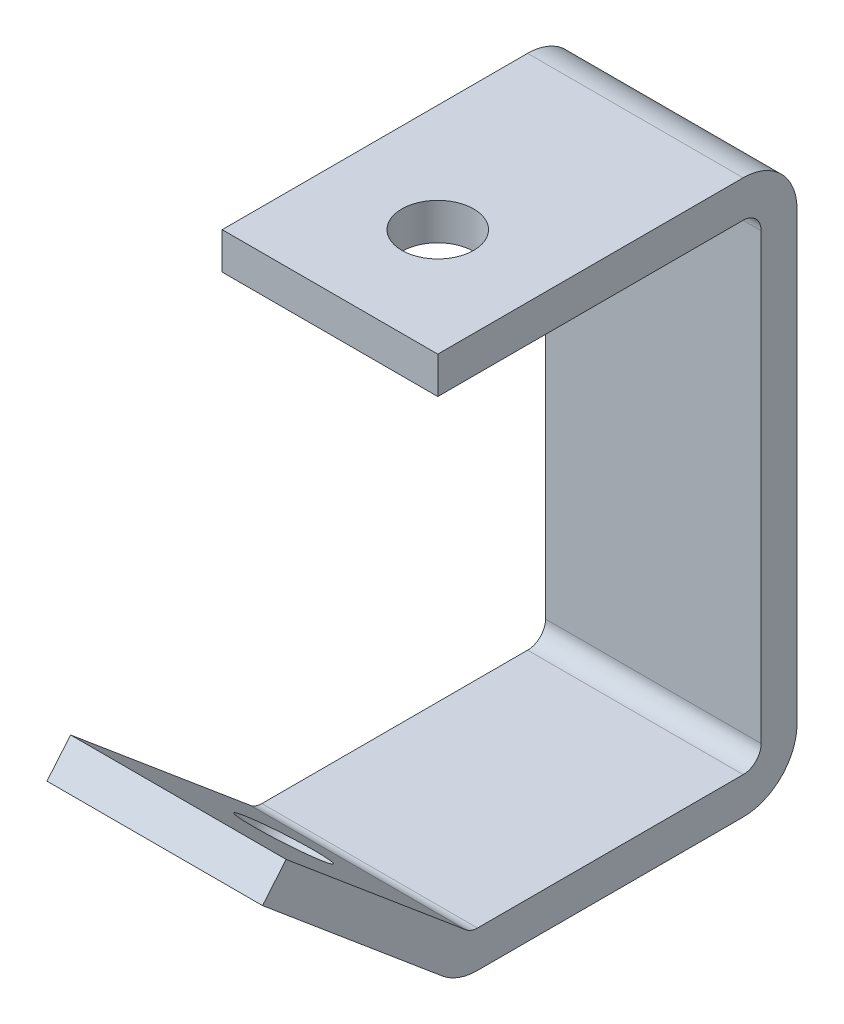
ISO-10303-21;
HEADER;
FILE_DESCRIPTION(('STEP AP214'),'2;1');
FILE_NAME('part.step','',(''),(''),'','','');
FILE_SCHEMA(('AUTOMOTIVE_DESIGN { 1 0 10303 214 1 1 1 1 }'));
ENDSEC;
DATA;
#1=APPLICATION_CONTEXT('core data for automotive mechanical design processes');
#2=APPLICATION_PROTOCOL_DEFINITION('international standard','automotive_design',2000,#1);
#3=PRODUCT_CONTEXT('',#1,'mechanical');
#4=PRODUCT('Part','Part','',(#3));
#5=PRODUCT_RELATED_PRODUCT_CATEGORY('part','',(#4));
#6=PRODUCT_DEFINITION_FORMATION('','',#4);
#7=PRODUCT_DEFINITION_CONTEXT('part definition',#1,'design');
#8=PRODUCT_DEFINITION('design','',#6,#7);
#9=PRODUCT_DEFINITION_SHAPE('','',#8);
#10=(LENGTH_UNIT() NAMED_UNIT(*) SI_UNIT(.MILLI.,.METRE.));
#11=(NAMED_UNIT(*) PLANE_ANGLE_UNIT() SI_UNIT($,.RADIAN.));
#12=(NAMED_UNIT(*) SI_UNIT($,.STERADIAN.) SOLID_ANGLE_UNIT());
#13=UNCERTAINTY_MEASURE_WITH_UNIT(LENGTH_MEASURE(1.E-05),#10,'distance_accuracy_value','');
#14=(GEOMETRIC_REPRESENTATION_CONTEXT(3) GLOBAL_UNCERTAINTY_ASSIGNED_CONTEXT((#13)) GLOBAL_UNIT_ASSIGNED_CONTEXT((#10,
#11,#12)) REPRESENTATION_CONTEXT('',''));
#15=CARTESIAN_POINT('',(0.,0.,0.));
#16=DIRECTION('',(0.,0.,1.));
#17=DIRECTION('',(1.,0.,0.));
#18=AXIS2_PLACEMENT_3D('',#15,#16,#17);
#19=CARTESIAN_POINT('',(19.05,91.35,0.));
#20=DIRECTION('',(0.,0.,-1.));
#21=DIRECTION('',(0.,1.,0.));
#22=AXIS2_PLACEMENT_3D('',#19,#20,#21);
#23=PLANE('',#22);
#24=DIRECTION('',(0.,-1.,0.));
#25=VECTOR('',#24,1.);
#26=CARTESIAN_POINT('',(-19.05,91.35,0.));
#27=LINE('',#26,#25);
#28=CARTESIAN_POINT('',(-19.05,81.675,0.));
#29=VERTEX_POINT('',#28);
#30=CARTESIAN_POINT('',(-19.05,3.17499999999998,0.));
#31=VERTEX_POINT('',#30);
#32=EDGE_CURVE('E188',#29,#31,#27,.T.);
#33=ORIENTED_EDGE('',*,*,#32,.T.);
#34=DIRECTION('',(1.,0.,0.));
#35=VECTOR('',#34,1.);
#36=CARTESIAN_POINT('',(19.05,3.17499999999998,0.));
#37=LINE('',#36,#35);
#38=CARTESIAN_POINT('',(19.05,3.17499999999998,0.));
#39=VERTEX_POINT('',#38);
#40=EDGE_CURVE('E243',#31,#39,#37,.T.);
#41=ORIENTED_EDGE('',*,*,#40,.T.);
#42=DIRECTION('',(0.,-1.,0.));
#43=VECTOR('',#42,1.);
#44=CARTESIAN_POINT('',(19.05,91.35,0.));
#45=LINE('',#44,#43);
#46=CARTESIAN_POINT('',(19.05,81.675,0.));
#47=VERTEX_POINT('',#46);
#48=EDGE_CURVE('E185',#47,#39,#45,.T.);
#49=ORIENTED_EDGE('',*,*,#48,.F.);
#50=DIRECTION('',(1.,0.,0.));
#51=VECTOR('',#50,1.);
#52=CARTESIAN_POINT('',(-19.05,81.675,0.));
#53=LINE('',#52,#51);
#54=EDGE_CURVE('E227',#47,#29,#53,.F.);
#55=ORIENTED_EDGE('',*,*,#54,.T.);
#56=EDGE_LOOP('',(#33,#41,#49,#55));
#57=FACE_BOUND('',#56,.T.);
#58=ADVANCED_FACE('F34',(#57),#23,.F.);
#59=CARTESIAN_POINT('',(-19.05,0.,-6.34999999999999));
#60=DIRECTION('',(0.,1.,0.));
#61=DIRECTION('',(0.,0.,1.));
#62=AXIS2_PLACEMENT_3D('',#59,#60,#61);
#63=PLANE('',#62);
#64=DIRECTION('',(0.,0.,1.));
#65=VECTOR('',#64,1.);
#66=CARTESIAN_POINT('',(19.05,0.,-6.34999999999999));
#67=LINE('',#66,#65);
#68=CARTESIAN_POINT('',(19.05,0.,3.175));
#69=VERTEX_POINT('',#68);
#70=CARTESIAN_POINT('',(19.05,0.,50.1285879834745));
#71=VERTEX_POINT('',#70);
#72=EDGE_CURVE('E212',#69,#71,#67,.T.);
#73=ORIENTED_EDGE('',*,*,#72,.F.);
#74=DIRECTION('',(1.,0.,0.));
#75=VECTOR('',#74,1.);
#76=CARTESIAN_POINT('',(-19.05,0.,3.175));
#77=LINE('',#76,#75);
#78=CARTESIAN_POINT('',(-19.05,0.,3.175));
#79=VERTEX_POINT('',#78);
#80=EDGE_CURVE('E246',#69,#79,#77,.F.);
#81=ORIENTED_EDGE('',*,*,#80,.T.);
#82=DIRECTION('',(0.,0.,1.));
#83=VECTOR('',#82,1.);
#84=CARTESIAN_POINT('',(-19.05,0.,-6.34999999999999));
#85=LINE('',#84,#83);
#86=CARTESIAN_POINT('',(-19.05,0.,50.1285879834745));
#87=VERTEX_POINT('',#86);
#88=EDGE_CURVE('E198',#79,#87,#85,.T.);
#89=ORIENTED_EDGE('',*,*,#88,.T.);
#90=DIRECTION('',(1.,0.,0.));
#91=VECTOR('',#90,1.);
#92=CARTESIAN_POINT('',(19.05,0.,50.1285879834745));
#93=LINE('',#92,#91);
#94=EDGE_CURVE('E233',#87,#71,#93,.T.);
#95=ORIENTED_EDGE('',*,*,#94,.T.);
#96=EDGE_LOOP('',(#73,#81,#89,#95));
#97=FACE_BOUND('',#96,.T.);
#98=ADVANCED_FACE('F300',(#97),#63,.T.);
#99=CARTESIAN_POINT('',(-19.05,-6.5,53.65));
#100=DIRECTION('',(0.,-1.,0.));
#101=DIRECTION('',(0.,0.,-1.));
#102=AXIS2_PLACEMENT_3D('',#99,#100,#101);
#103=PLANE('',#102);
#104=DIRECTION('',(0.,0.,-1.));
#105=VECTOR('',#104,1.);
#106=CARTESIAN_POINT('',(19.05,-6.5,53.65));
#107=LINE('',#106,#105);
#108=CARTESIAN_POINT('',(19.05,-6.5,50.1831835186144));
#109=VERTEX_POINT('',#108);
#110=CARTESIAN_POINT('',(19.05,-6.5,3.17500000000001));
#111=VERTEX_POINT('',#110);
#112=EDGE_CURVE('E191',#109,#111,#107,.T.);
#113=ORIENTED_EDGE('',*,*,#112,.F.);
#114=DIRECTION('',(1.,0.,0.));
#115=VECTOR('',#114,1.);
#116=CARTESIAN_POINT('',(-19.05,-6.5,50.1831835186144));
#117=LINE('',#116,#115);
#118=CARTESIAN_POINT('',(-19.05,-6.5,50.1831835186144));
#119=VERTEX_POINT('',#118);
#120=EDGE_CURVE('E42',#109,#119,#117,.F.);
#121=ORIENTED_EDGE('',*,*,#120,.T.);
#122=DIRECTION('',(0.,0.,-1.));
#123=VECTOR('',#122,1.);
#124=CARTESIAN_POINT('',(-19.05,-6.5,53.65));
#125=LINE('',#124,#123);
#126=CARTESIAN_POINT('',(-19.05,-6.5,3.17500000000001));
#127=VERTEX_POINT('',#126);
#128=EDGE_CURVE('E192',#119,#127,#125,.T.);
#129=ORIENTED_EDGE('',*,*,#128,.T.);
#130=DIRECTION('',(1.,0.,0.));
#131=VECTOR('',#130,1.);
#132=CARTESIAN_POINT('',(-19.05,-6.5,3.17500000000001));
#133=LINE('',#132,#131);
#134=EDGE_CURVE('E252',#127,#111,#133,.T.);
#135=ORIENTED_EDGE('',*,*,#134,.T.);
#136=EDGE_LOOP('',(#113,#121,#129,#135));
#137=FACE_BOUND('',#136,.T.);
#138=ADVANCED_FACE('F306',(#137),#103,.T.);
#139=CARTESIAN_POINT('',(-19.05,22.4254424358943,88.121999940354));
#140=DIRECTION('',(0.,-0.766044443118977,0.64278760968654));
#141=DIRECTION('',(0.,-0.64278760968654,-0.766044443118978));
#142=AXIS2_PLACEMENT_3D('',#139,#140,#141);
#143=PLANE('',#142);
#144=CARTESIAN_POINT('',(-1.23956400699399E-13,6.81179721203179,69.5143821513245));
#145=DIRECTION('',(0.,-0.766044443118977,0.64278760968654));
#146=DIRECTION('',(0.,-0.64278760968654,-0.766044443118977));
#147=AXIS2_PLACEMENT_3D('',#144,#145,#146);
#148=CIRCLE('',#147,7.);
#149=CARTESIAN_POINT('',(-1.23956400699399E-13,2.31228394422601,64.1520710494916));
#150=VERTEX_POINT('',#149);
#151=EDGE_CURVE('E390',#150,#150,#148,.T.);
#152=ORIENTED_EDGE('',*,*,#151,.F.);
#153=EDGE_LOOP('',(#152));
#154=FACE_BOUND('',#153,.T.);
#155=DIRECTION('',(0.,-0.64278760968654,-0.766044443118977));
#156=VECTOR('',#155,1.);
#157=CARTESIAN_POINT('',(-19.05,22.4254424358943,88.121999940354));
#158=LINE('',#157,#156);
#159=CARTESIAN_POINT('',(-19.05,22.4254424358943,88.121999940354));
#160=VERTEX_POINT('',#159);
#161=CARTESIAN_POINT('',(-19.05,-4.27157332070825,56.3057355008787));
#162=VERTEX_POINT('',#161);
#163=EDGE_CURVE('E205',#160,#162,#158,.T.);
#164=ORIENTED_EDGE('',*,*,#163,.T.);
#165=DIRECTION('',(1.,0.,0.));
#166=VECTOR('',#165,1.);
#167=CARTESIAN_POINT('',(-19.05,-4.27157332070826,56.3057355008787));
#168=LINE('',#167,#166);
#169=CARTESIAN_POINT('',(19.05,-4.27157332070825,56.3057355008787));
#170=VERTEX_POINT('',#169);
#171=EDGE_CURVE('E269',#162,#170,#168,.T.);
#172=ORIENTED_EDGE('',*,*,#171,.T.);
#173=DIRECTION('',(0.,-0.64278760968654,-0.766044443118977));
#174=VECTOR('',#173,1.);
#175=CARTESIAN_POINT('',(19.05,22.4254424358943,88.121999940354));
#176=LINE('',#175,#174);
#177=CARTESIAN_POINT('',(19.05,22.4254424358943,88.121999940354));
#178=VERTEX_POINT('',#177);
#179=EDGE_CURVE('E195',#178,#170,#176,.T.);
#180=ORIENTED_EDGE('',*,*,#179,.F.);
#181=DIRECTION('',(1.,0.,0.));
#182=VECTOR('',#181,1.);
#183=CARTESIAN_POINT('',(-19.05,22.4254424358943,88.121999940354));
#184=LINE('',#183,#182);
#185=EDGE_CURVE('E220',#160,#178,#184,.T.);
#186=ORIENTED_EDGE('',*,*,#185,.F.);
#187=EDGE_LOOP('',(#164,#172,#180,#186));
#188=FACE_BOUND('',#187,.T.);
#189=ADVANCED_FACE('F275',(#154,#188),#143,.T.);
#190=CARTESIAN_POINT('',(-19.05,27.4047313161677,83.9438804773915));
#191=DIRECTION('',(0.,0.64278760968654,0.766044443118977));
#192=DIRECTION('',(0.,-0.766044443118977,0.64278760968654));
#193=AXIS2_PLACEMENT_3D('',#190,#191,#192);
#194=PLANE('',#193);
#195=DIRECTION('',(0.,-0.766044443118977,0.64278760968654));
#196=VECTOR('',#195,1.);
#197=CARTESIAN_POINT('',(19.05,27.4047313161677,83.9438804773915));
#198=LINE('',#197,#196);
#199=CARTESIAN_POINT('',(19.05,27.4047313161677,83.9438804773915));
#200=VERTEX_POINT('',#199);
#201=EDGE_CURVE('E216',#200,#178,#198,.T.);
#202=ORIENTED_EDGE('',*,*,#201,.F.);
#203=DIRECTION('',(1.,0.,0.));
#204=VECTOR('',#203,1.);
#205=CARTESIAN_POINT('',(-19.05,27.4047313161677,83.9438804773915));
#206=LINE('',#205,#204);
#207=CARTESIAN_POINT('',(-19.05,27.4047313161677,83.9438804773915));
#208=VERTEX_POINT('',#207);
#209=EDGE_CURVE('E208',#208,#200,#206,.T.);
#210=ORIENTED_EDGE('',*,*,#209,.F.);
#211=DIRECTION('',(0.,-0.766044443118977,0.64278760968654));
#212=VECTOR('',#211,1.);
#213=CARTESIAN_POINT('',(-19.05,27.4047313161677,83.9438804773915));
#214=LINE('',#213,#212);
#215=EDGE_CURVE('E202',#208,#160,#214,.T.);
#216=ORIENTED_EDGE('',*,*,#215,.T.);
#217=ORIENTED_EDGE('',*,*,#185,.T.);
#218=EDGE_LOOP('',(#202,#210,#216,#217));
#219=FACE_BOUND('',#218,.T.);
#220=ADVANCED_FACE('F283',(#219),#194,.T.);
#221=CARTESIAN_POINT('',(-19.05,0.,51.2841934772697));
#222=DIRECTION('',(0.,0.766044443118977,-0.64278760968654));
#223=DIRECTION('',(0.,0.64278760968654,0.766044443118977));
#224=AXIS2_PLACEMENT_3D('',#221,#222,#223);
#225=PLANE('',#224);
#226=CARTESIAN_POINT('',(-1.23956400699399E-13,11.7910860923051,65.3362626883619));
#227=DIRECTION('',(0.,0.766044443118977,-0.64278760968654));
#228=DIRECTION('',(0.,0.64278760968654,0.766044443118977));
#229=AXIS2_PLACEMENT_3D('',#226,#227,#228);
#230=CIRCLE('',#229,7.);
#231=CARTESIAN_POINT('',(-1.23956400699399E-13,16.2905993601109,70.6985737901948));
#232=VERTEX_POINT('',#231);
#233=EDGE_CURVE('E392',#232,#232,#230,.F.);
#234=ORIENTED_EDGE('',*,*,#233,.T.);
#235=EDGE_LOOP('',(#234));
#236=FACE_BOUND('',#235,.T.);
#237=DIRECTION('',(0.,0.64278760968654,0.766044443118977));
#238=VECTOR('',#237,1.);
#239=CARTESIAN_POINT('',(19.05,0.,51.2841934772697));
#240=LINE('',#239,#238);
#241=CARTESIAN_POINT('',(19.05,0.74280889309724,52.1694386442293));
#242=VERTEX_POINT('',#241);
#243=EDGE_CURVE('E214',#242,#200,#240,.T.);
#244=ORIENTED_EDGE('',*,*,#243,.F.);
#245=DIRECTION('',(1.,0.,0.));
#246=VECTOR('',#245,1.);
#247=CARTESIAN_POINT('',(-19.05,0.74280889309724,52.1694386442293));
#248=LINE('',#247,#246);
#249=CARTESIAN_POINT('',(-19.05,0.74280889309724,52.1694386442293));
#250=VERTEX_POINT('',#249);
#251=EDGE_CURVE('E236',#242,#250,#248,.F.);
#252=ORIENTED_EDGE('',*,*,#251,.T.);
#253=DIRECTION('',(0.,0.64278760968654,0.766044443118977));
#254=VECTOR('',#253,1.);
#255=CARTESIAN_POINT('',(-19.05,0.,51.2841934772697));
#256=LINE('',#255,#254);
#257=EDGE_CURVE('E200',#250,#208,#256,.T.);
#258=ORIENTED_EDGE('',*,*,#257,.T.);
#259=ORIENTED_EDGE('',*,*,#209,.T.);
#260=EDGE_LOOP('',(#244,#252,#258,#259));
#261=FACE_BOUND('',#260,.T.);
#262=ADVANCED_FACE('F322',(#236,#261),#225,.T.);
#263=CARTESIAN_POINT('',(-19.05,-6.5,-6.34999999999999));
#264=DIRECTION('',(0.,0.,-1.));
#265=DIRECTION('',(0.,1.,0.));
#266=AXIS2_PLACEMENT_3D('',#263,#264,#265);
#267=PLANE('',#266);
#268=DIRECTION('',(0.,1.,0.));
#269=VECTOR('',#268,1.);
#270=CARTESIAN_POINT('',(-19.05,-6.5,-6.34999999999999));
#271=LINE('',#270,#269);
#272=CARTESIAN_POINT('',(-19.05,3.025,-6.34999999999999));
#273=VERTEX_POINT('',#272);
#274=CARTESIAN_POINT('',(-19.05,81.825,-6.34999999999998));
#275=VERTEX_POINT('',#274);
#276=EDGE_CURVE('E194',#273,#275,#271,.T.);
#277=ORIENTED_EDGE('',*,*,#276,.T.);
#278=DIRECTION('',(-1.,0.,0.));
#279=VECTOR('',#278,1.);
#280=CARTESIAN_POINT('',(19.05,81.825,-6.34999999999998));
#281=LINE('',#280,#279);
#282=CARTESIAN_POINT('',(19.05,81.825,-6.34999999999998));
#283=VERTEX_POINT('',#282);
#284=EDGE_CURVE('E266',#275,#283,#281,.F.);
#285=ORIENTED_EDGE('',*,*,#284,.T.);
#286=DIRECTION('',(0.,1.,0.));
#287=VECTOR('',#286,1.);
#288=CARTESIAN_POINT('',(19.05,-6.5,-6.34999999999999));
#289=LINE('',#288,#287);
#290=CARTESIAN_POINT('',(19.05,3.025,-6.34999999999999));
#291=VERTEX_POINT('',#290);
#292=EDGE_CURVE('E210',#291,#283,#289,.T.);
#293=ORIENTED_EDGE('',*,*,#292,.F.);
#294=DIRECTION('',(1.,0.,0.));
#295=VECTOR('',#294,1.);
#296=CARTESIAN_POINT('',(-19.05,3.025,-6.34999999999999));
#297=LINE('',#296,#295);
#298=EDGE_CURVE('E257',#291,#273,#297,.F.);
#299=ORIENTED_EDGE('',*,*,#298,.T.);
#300=EDGE_LOOP('',(#277,#285,#293,#299));
#301=FACE_BOUND('',#300,.T.);
#302=ADVANCED_FACE('F314',(#301),#267,.T.);
#303=CARTESIAN_POINT('',(-19.05,-6.5,-6.34999999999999));
#304=DIRECTION('',(1.,0.,0.));
#305=DIRECTION('',(0.,0.,-1.));
#306=AXIS2_PLACEMENT_3D('',#303,#304,#305);
#307=PLANE('',#306);
#308=ORIENTED_EDGE('',*,*,#128,.F.);
#309=CARTESIAN_POINT('',(-19.05,3.025,50.1831835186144));
#310=DIRECTION('',(1.,0.,0.));
#311=DIRECTION('',(0.,0.,-1.));
#312=AXIS2_PLACEMENT_3D('',#309,#310,#311);
#313=CIRCLE('',#312,9.525);
#314=EDGE_CURVE('E11',#119,#162,#313,.F.);
#315=ORIENTED_EDGE('',*,*,#314,.T.);
#316=ORIENTED_EDGE('',*,*,#163,.F.);
#317=ORIENTED_EDGE('',*,*,#215,.F.);
#318=ORIENTED_EDGE('',*,*,#257,.F.);
#319=CARTESIAN_POINT('',(-19.05,3.17499999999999,50.1285879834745));
#320=DIRECTION('',(1.,0.,0.));
#321=DIRECTION('',(0.,0.,-1.));
#322=AXIS2_PLACEMENT_3D('',#319,#320,#321);
#323=CIRCLE('',#322,3.175);
#324=EDGE_CURVE('E240',#250,#87,#323,.T.);
#325=ORIENTED_EDGE('',*,*,#324,.T.);
#326=ORIENTED_EDGE('',*,*,#88,.F.);
#327=CARTESIAN_POINT('',(-19.05,3.17499999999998,3.175));
#328=DIRECTION('',(1.,0.,0.));
#329=DIRECTION('',(0.,0.,-1.));
#330=AXIS2_PLACEMENT_3D('',#327,#328,#329);
#331=CIRCLE('',#330,3.175);
#332=EDGE_CURVE('E250',#79,#31,#331,.T.);
#333=ORIENTED_EDGE('',*,*,#332,.T.);
#334=ORIENTED_EDGE('',*,*,#32,.F.);
#335=CARTESIAN_POINT('',(-19.05,81.675,3.17499999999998));
#336=DIRECTION('',(1.,0.,0.));
#337=DIRECTION('',(0.,0.,-1.));
#338=AXIS2_PLACEMENT_3D('',#335,#336,#337);
#339=CIRCLE('',#338,3.175);
#340=CARTESIAN_POINT('',(-19.05,84.85,3.17499999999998));
#341=VERTEX_POINT('',#340);
#342=EDGE_CURVE('E231',#29,#341,#339,.T.);
#343=ORIENTED_EDGE('',*,*,#342,.T.);
#344=DIRECTION('',(0.,0.,-1.));
#345=VECTOR('',#344,1.);
#346=CARTESIAN_POINT('',(-19.05,84.85,57.15));
#347=LINE('',#346,#345);
#348=CARTESIAN_POINT('',(-19.05,84.85,57.15));
#349=VERTEX_POINT('',#348);
#350=EDGE_CURVE('E157',#349,#341,#347,.T.);
#351=ORIENTED_EDGE('',*,*,#350,.F.);
#352=DIRECTION('',(0.,-1.,0.));
#353=VECTOR('',#352,1.);
#354=CARTESIAN_POINT('',(-19.05,84.85,57.15));
#355=LINE('',#354,#353);
#356=CARTESIAN_POINT('',(-19.05,91.35,57.15));
#357=VERTEX_POINT('',#356);
#358=EDGE_CURVE('E165',#357,#349,#355,.T.);
#359=ORIENTED_EDGE('',*,*,#358,.F.);
#360=DIRECTION('',(0.,0.,1.));
#361=VECTOR('',#360,1.);
#362=CARTESIAN_POINT('',(-19.05,91.35,0.));
#363=LINE('',#362,#361);
#364=CARTESIAN_POINT('',(-19.05,91.35,3.17500000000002));
#365=VERTEX_POINT('',#364);
#366=EDGE_CURVE('E156',#365,#357,#363,.T.);
#367=ORIENTED_EDGE('',*,*,#366,.F.);
#368=CARTESIAN_POINT('',(-19.05,81.825,3.17500000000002));
#369=DIRECTION('',(1.,0.,0.));
#370=DIRECTION('',(0.,0.,-1.));
#371=AXIS2_PLACEMENT_3D('',#368,#369,#370);
#372=CIRCLE('',#371,9.525);
#373=EDGE_CURVE('E264',#365,#275,#372,.F.);
#374=ORIENTED_EDGE('',*,*,#373,.T.);
#375=ORIENTED_EDGE('',*,*,#276,.F.);
#376=CARTESIAN_POINT('',(-19.05,3.025,3.17500000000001));
#377=DIRECTION('',(1.,0.,0.));
#378=DIRECTION('',(0.,0.,-1.));
#379=AXIS2_PLACEMENT_3D('',#376,#377,#378);
#380=CIRCLE('',#379,9.525);
#381=EDGE_CURVE('E259',#273,#127,#380,.F.);
#382=ORIENTED_EDGE('',*,*,#381,.T.);
#383=EDGE_LOOP('',(#308,#315,#316,#317,#318,#325,#326,#333,#334,#343,#351,#359,#367,#374,#375,#382));
#384=FACE_BOUND('',#383,.T.);
#385=ADVANCED_FACE('F287',(#384),#307,.F.);
#386=CARTESIAN_POINT('',(19.05,-6.5,-6.34999999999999));
#387=DIRECTION('',(1.,0.,0.));
#388=DIRECTION('',(0.,0.,-1.));
#389=AXIS2_PLACEMENT_3D('',#386,#387,#388);
#390=PLANE('',#389);
#391=ORIENTED_EDGE('',*,*,#179,.T.);
#392=CARTESIAN_POINT('',(19.05,3.025,50.1831835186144));
#393=DIRECTION('',(1.,0.,0.));
#394=DIRECTION('',(0.,0.,-1.));
#395=AXIS2_PLACEMENT_3D('',#392,#393,#394);
#396=CIRCLE('',#395,9.525);
#397=EDGE_CURVE('E56',#170,#109,#396,.T.);
#398=ORIENTED_EDGE('',*,*,#397,.T.);
#399=ORIENTED_EDGE('',*,*,#112,.T.);
#400=CARTESIAN_POINT('',(19.05,3.025,3.17500000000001));
#401=DIRECTION('',(1.,0.,0.));
#402=DIRECTION('',(0.,0.,-1.));
#403=AXIS2_PLACEMENT_3D('',#400,#401,#402);
#404=CIRCLE('',#403,9.525);
#405=EDGE_CURVE('E255',#111,#291,#404,.T.);
#406=ORIENTED_EDGE('',*,*,#405,.T.);
#407=ORIENTED_EDGE('',*,*,#292,.T.);
#408=CARTESIAN_POINT('',(19.05,81.825,3.17500000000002));
#409=DIRECTION('',(1.,0.,0.));
#410=DIRECTION('',(0.,0.,-1.));
#411=AXIS2_PLACEMENT_3D('',#408,#409,#410);
#412=CIRCLE('',#411,9.525);
#413=CARTESIAN_POINT('',(19.05,91.35,3.17500000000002));
#414=VERTEX_POINT('',#413);
#415=EDGE_CURVE('E152',#283,#414,#412,.T.);
#416=ORIENTED_EDGE('',*,*,#415,.T.);
#417=DIRECTION('',(0.,0.,-1.));
#418=VECTOR('',#417,1.);
#419=CARTESIAN_POINT('',(19.05,91.35,-6.35000000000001));
#420=LINE('',#419,#418);
#421=CARTESIAN_POINT('',(19.05,91.35,57.15));
#422=VERTEX_POINT('',#421);
#423=EDGE_CURVE('E144',#422,#414,#420,.T.);
#424=ORIENTED_EDGE('',*,*,#423,.F.);
#425=DIRECTION('',(0.,1.,0.));
#426=VECTOR('',#425,1.);
#427=CARTESIAN_POINT('',(19.05,91.35,57.15));
#428=LINE('',#427,#426);
#429=CARTESIAN_POINT('',(19.05,84.85,57.15));
#430=VERTEX_POINT('',#429);
#431=EDGE_CURVE('E149',#430,#422,#428,.T.);
#432=ORIENTED_EDGE('',*,*,#431,.F.);
#433=DIRECTION('',(0.,0.,-1.));
#434=VECTOR('',#433,1.);
#435=CARTESIAN_POINT('',(19.05,84.85,57.15));
#436=LINE('',#435,#434);
#437=CARTESIAN_POINT('',(19.05,84.85,3.17499999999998));
#438=VERTEX_POINT('',#437);
#439=EDGE_CURVE('E180',#430,#438,#436,.T.);
#440=ORIENTED_EDGE('',*,*,#439,.T.);
#441=CARTESIAN_POINT('',(19.05,81.675,3.17499999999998));
#442=DIRECTION('',(1.,0.,0.));
#443=DIRECTION('',(0.,0.,-1.));
#444=AXIS2_PLACEMENT_3D('',#441,#442,#443);
#445=CIRCLE('',#444,3.175);
#446=EDGE_CURVE('E229',#438,#47,#445,.F.);
#447=ORIENTED_EDGE('',*,*,#446,.T.);
#448=ORIENTED_EDGE('',*,*,#48,.T.);
#449=CARTESIAN_POINT('',(19.05,3.17499999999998,3.175));
#450=DIRECTION('',(1.,0.,0.));
#451=DIRECTION('',(0.,0.,-1.));
#452=AXIS2_PLACEMENT_3D('',#449,#450,#451);
#453=CIRCLE('',#452,3.175);
#454=EDGE_CURVE('E248',#39,#69,#453,.F.);
#455=ORIENTED_EDGE('',*,*,#454,.T.);
#456=ORIENTED_EDGE('',*,*,#72,.T.);
#457=CARTESIAN_POINT('',(19.05,3.17499999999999,50.1285879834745));
#458=DIRECTION('',(1.,0.,0.));
#459=DIRECTION('',(0.,0.,-1.));
#460=AXIS2_PLACEMENT_3D('',#457,#458,#459);
#461=CIRCLE('',#460,3.175);
#462=EDGE_CURVE('E238',#71,#242,#461,.F.);
#463=ORIENTED_EDGE('',*,*,#462,.T.);
#464=ORIENTED_EDGE('',*,*,#243,.T.);
#465=ORIENTED_EDGE('',*,*,#201,.T.);
#466=EDGE_LOOP('',(#391,#398,#399,#406,#407,#416,#424,#432,#440,#447,#448,#455,#456,#463,#464,#465));
#467=FACE_BOUND('',#466,.T.);
#468=ADVANCED_FACE('F146',(#467),#390,.T.);
#469=CARTESIAN_POINT('',(19.05,91.35,0.));
#470=DIRECTION('',(0.,-1.,0.));
#471=DIRECTION('',(0.,0.,-1.));
#472=AXIS2_PLACEMENT_3D('',#469,#470,#471);
#473=PLANE('',#472);
#474=CARTESIAN_POINT('',(0.,91.35,38.1));
#475=DIRECTION('',(0.,1.,0.));
#476=DIRECTION('',(0.,0.,1.));
#477=AXIS2_PLACEMENT_3D('',#474,#475,#476);
#478=CIRCLE('',#477,6.35);
#479=CARTESIAN_POINT('',(0.,91.35,44.45));
#480=VERTEX_POINT('',#479);
#481=EDGE_CURVE('E174',#480,#480,#478,.T.);
#482=ORIENTED_EDGE('',*,*,#481,.F.);
#483=EDGE_LOOP('',(#482));
#484=FACE_BOUND('',#483,.T.);
#485=ORIENTED_EDGE('',*,*,#423,.T.);
#486=DIRECTION('',(-1.,0.,0.));
#487=VECTOR('',#486,1.);
#488=CARTESIAN_POINT('',(-19.05,91.35,3.17500000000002));
#489=LINE('',#488,#487);
#490=EDGE_CURVE('E262',#414,#365,#489,.T.);
#491=ORIENTED_EDGE('',*,*,#490,.T.);
#492=ORIENTED_EDGE('',*,*,#366,.T.);
#493=DIRECTION('',(-1.,0.,0.));
#494=VECTOR('',#493,1.);
#495=CARTESIAN_POINT('',(-19.05,91.35,57.15));
#496=LINE('',#495,#494);
#497=EDGE_CURVE('E160',#422,#357,#496,.T.);
#498=ORIENTED_EDGE('',*,*,#497,.F.);
#499=EDGE_LOOP('',(#485,#491,#492,#498));
#500=FACE_BOUND('',#499,.T.);
#501=ADVANCED_FACE('F161',(#484,#500),#473,.F.);
#502=CARTESIAN_POINT('',(19.05,84.85,57.15));
#503=DIRECTION('',(0.,1.,0.));
#504=DIRECTION('',(0.,0.,1.));
#505=AXIS2_PLACEMENT_3D('',#502,#503,#504);
#506=PLANE('',#505);
#507=CARTESIAN_POINT('',(0.,84.85,38.1));
#508=DIRECTION('',(0.,1.,0.));
#509=DIRECTION('',(0.,0.,1.));
#510=AXIS2_PLACEMENT_3D('',#507,#508,#509);
#511=CIRCLE('',#510,6.35);
#512=CARTESIAN_POINT('',(0.,84.85,44.45));
#513=VERTEX_POINT('',#512);
#514=EDGE_CURVE('E171',#513,#513,#511,.T.);
#515=ORIENTED_EDGE('',*,*,#514,.T.);
#516=EDGE_LOOP('',(#515));
#517=FACE_BOUND('',#516,.T.);
#518=ORIENTED_EDGE('',*,*,#350,.T.);
#519=DIRECTION('',(1.,0.,0.));
#520=VECTOR('',#519,1.);
#521=CARTESIAN_POINT('',(19.05,84.85,3.17499999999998));
#522=LINE('',#521,#520);
#523=EDGE_CURVE('E222',#341,#438,#522,.T.);
#524=ORIENTED_EDGE('',*,*,#523,.T.);
#525=ORIENTED_EDGE('',*,*,#439,.F.);
#526=DIRECTION('',(1.,0.,0.));
#527=VECTOR('',#526,1.);
#528=CARTESIAN_POINT('',(19.05,84.85,57.15));
#529=LINE('',#528,#527);
#530=EDGE_CURVE('E169',#349,#430,#529,.T.);
#531=ORIENTED_EDGE('',*,*,#530,.F.);
#532=EDGE_LOOP('',(#518,#524,#525,#531));
#533=FACE_BOUND('',#532,.T.);
#534=ADVANCED_FACE('F360',(#517,#533),#506,.F.);
#535=CARTESIAN_POINT('',(19.05,84.85,57.15));
#536=DIRECTION('',(0.,0.,-1.));
#537=DIRECTION('',(-1.,0.,0.));
#538=AXIS2_PLACEMENT_3D('',#535,#536,#537);
#539=PLANE('',#538);
#540=ORIENTED_EDGE('',*,*,#431,.T.);
#541=ORIENTED_EDGE('',*,*,#497,.T.);
#542=ORIENTED_EDGE('',*,*,#358,.T.);
#543=ORIENTED_EDGE('',*,*,#530,.T.);
#544=EDGE_LOOP('',(#540,#541,#542,#543));
#545=FACE_BOUND('',#544,.T.);
#546=ADVANCED_FACE('F167',(#545),#539,.F.);
#547=CARTESIAN_POINT('',(0.,91.35,38.1));
#548=DIRECTION('',(0.,1.,0.));
#549=DIRECTION('',(0.,0.,1.));
#550=AXIS2_PLACEMENT_3D('',#547,#548,#549);
#551=CYLINDRICAL_SURFACE('',#550,6.35);
#552=ORIENTED_EDGE('',*,*,#514,.F.);
#553=EDGE_LOOP('',(#552));
#554=FACE_BOUND('',#553,.T.);
#555=ORIENTED_EDGE('',*,*,#481,.T.);
#556=EDGE_LOOP('',(#555));
#557=FACE_BOUND('',#556,.T.);
#558=ADVANCED_FACE('F335',(#554,#557),#551,.F.);
#559=CARTESIAN_POINT('',(19.05,81.675,3.17499999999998));
#560=DIRECTION('',(-1.,0.,0.));
#561=DIRECTION('',(0.,0.,1.));
#562=AXIS2_PLACEMENT_3D('',#559,#560,#561);
#563=CYLINDRICAL_SURFACE('',#562,3.175);
#564=ORIENTED_EDGE('',*,*,#342,.F.);
#565=ORIENTED_EDGE('',*,*,#54,.F.);
#566=ORIENTED_EDGE('',*,*,#446,.F.);
#567=ORIENTED_EDGE('',*,*,#523,.F.);
#568=EDGE_LOOP('',(#564,#565,#566,#567));
#569=FACE_BOUND('',#568,.T.);
#570=ADVANCED_FACE('F331',(#569),#563,.F.);
#571=CARTESIAN_POINT('',(-19.05,3.17499999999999,50.1285879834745));
#572=DIRECTION('',(-1.,0.,0.));
#573=DIRECTION('',(0.,0.,1.));
#574=AXIS2_PLACEMENT_3D('',#571,#572,#573);
#575=CYLINDRICAL_SURFACE('',#574,3.175);
#576=ORIENTED_EDGE('',*,*,#324,.F.);
#577=ORIENTED_EDGE('',*,*,#251,.F.);
#578=ORIENTED_EDGE('',*,*,#462,.F.);
#579=ORIENTED_EDGE('',*,*,#94,.F.);
#580=EDGE_LOOP('',(#576,#577,#578,#579));
#581=FACE_BOUND('',#580,.T.);
#582=ADVANCED_FACE('F334',(#581),#575,.F.);
#583=CARTESIAN_POINT('',(19.05,3.17499999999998,3.175));
#584=DIRECTION('',(1.,0.,0.));
#585=DIRECTION('',(0.,0.,-1.));
#586=AXIS2_PLACEMENT_3D('',#583,#584,#585);
#587=CYLINDRICAL_SURFACE('',#586,3.175);
#588=ORIENTED_EDGE('',*,*,#332,.F.);
#589=ORIENTED_EDGE('',*,*,#80,.F.);
#590=ORIENTED_EDGE('',*,*,#454,.F.);
#591=ORIENTED_EDGE('',*,*,#40,.F.);
#592=EDGE_LOOP('',(#588,#589,#590,#591));
#593=FACE_BOUND('',#592,.T.);
#594=ADVANCED_FACE('F339',(#593),#587,.F.);
#595=CARTESIAN_POINT('',(-19.05,3.025,3.17500000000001));
#596=DIRECTION('',(1.,0.,0.));
#597=DIRECTION('',(0.,0.,-1.));
#598=AXIS2_PLACEMENT_3D('',#595,#596,#597);
#599=CYLINDRICAL_SURFACE('',#598,9.525);
#600=ORIENTED_EDGE('',*,*,#381,.F.);
#601=ORIENTED_EDGE('',*,*,#298,.F.);
#602=ORIENTED_EDGE('',*,*,#405,.F.);
#603=ORIENTED_EDGE('',*,*,#134,.F.);
#604=EDGE_LOOP('',(#600,#601,#602,#603));
#605=FACE_BOUND('',#604,.T.);
#606=ADVANCED_FACE('F297',(#605),#599,.T.);
#607=CARTESIAN_POINT('',(19.05,81.825,3.17500000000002));
#608=DIRECTION('',(1.,0.,0.));
#609=DIRECTION('',(0.,0.,-1.));
#610=AXIS2_PLACEMENT_3D('',#607,#608,#609);
#611=CYLINDRICAL_SURFACE('',#610,9.525);
#612=ORIENTED_EDGE('',*,*,#415,.F.);
#613=ORIENTED_EDGE('',*,*,#284,.F.);
#614=ORIENTED_EDGE('',*,*,#373,.F.);
#615=ORIENTED_EDGE('',*,*,#490,.F.);
#616=EDGE_LOOP('',(#612,#613,#614,#615));
#617=FACE_BOUND('',#616,.T.);
#618=ADVANCED_FACE('F290',(#617),#611,.T.);
#619=CARTESIAN_POINT('',(-19.05,3.025,50.1831835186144));
#620=DIRECTION('',(1.,0.,0.));
#621=DIRECTION('',(0.,0.,-1.));
#622=AXIS2_PLACEMENT_3D('',#619,#620,#621);
#623=CYLINDRICAL_SURFACE('',#622,9.525);
#624=ORIENTED_EDGE('',*,*,#314,.F.);
#625=ORIENTED_EDGE('',*,*,#120,.F.);
#626=ORIENTED_EDGE('',*,*,#397,.F.);
#627=ORIENTED_EDGE('',*,*,#171,.F.);
#628=EDGE_LOOP('',(#624,#625,#626,#627));
#629=FACE_BOUND('',#628,.T.);
#630=ADVANCED_FACE('F36',(#629),#623,.T.);
#631=CARTESIAN_POINT('',(-1.23956400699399E-13,93.7778461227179,-3.45879741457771));
#632=DIRECTION('',(0.,-0.766044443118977,0.64278760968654));
#633=DIRECTION('',(0.,-0.64278760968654,-0.766044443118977));
#634=AXIS2_PLACEMENT_3D('',#631,#632,#633);
#635=CYLINDRICAL_SURFACE('',#634,7.);
#636=ORIENTED_EDGE('',*,*,#233,.F.);
#637=EDGE_LOOP('',(#636));
#638=FACE_BOUND('',#637,.T.);
#639=ORIENTED_EDGE('',*,*,#151,.T.);
#640=EDGE_LOOP('',(#639));
#641=FACE_BOUND('',#640,.T.);
#642=ADVANCED_FACE('F289',(#638,#641),#635,.F.);
#643=CLOSED_SHELL('',(#58,#98,#138,#189,#220,#262,#302,#385,#468,#501,#534,#546,#558,#570,#582,
#594,#606,#618,#630,#642));
#644=MANIFOLD_SOLID_BREP('B2',#643);
#645=ADVANCED_BREP_SHAPE_REPRESENTATION('',(#18,#644),#14);
#646=SHAPE_DEFINITION_REPRESENTATION(#9,#645);
ENDSEC;
END-ISO-10303-21;
